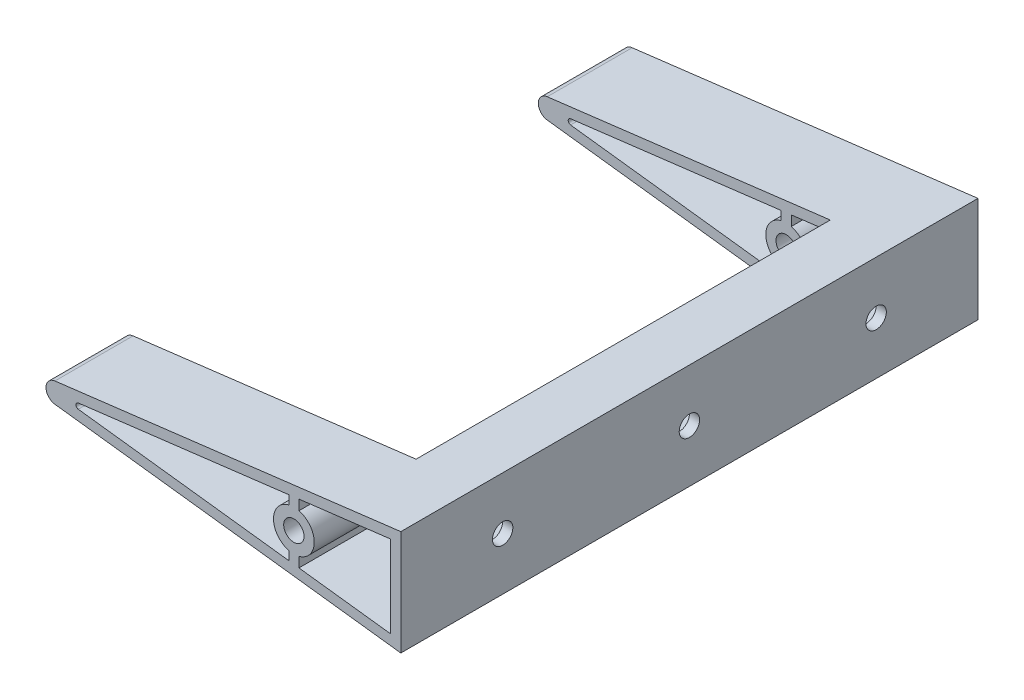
from build123d import *

# Parameters (mm, degrees)
ESQUISSE1_R             = 3
BOSS_EXTRU_1_DEPTH      = 120
ESQUISSE1_2_R           = 3
BOSS_EXTRU_2_DEPTH      = 170
ESQUISSE3_W             = 120
ESQUISSE3_H             = 122
ENL_V_MAT_EXTRU_1_DEPTH = 30
CONG_2_R                = 3
ESQUISSE4_R             = 3
ENL_V_MAT_EXTRU_2_DEPTH = 10


with BuildPart() as part:
    # Esquisse1 → Boss.-Extru.1 (new body)
    with BuildSketch(Plane.XY):
        Polygon((-94.616527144, 0), (31.5, 15.485162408), (31.5, -15.485162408), align=None)
        with Locations(Location((0, 0, 0), (0, 0, 180))):
            Circle(ESQUISSE1_R, mode=Mode.SUBTRACT)
        with BuildLine():
            Line((28.5, 12.094279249), (28.5, -12.094279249))
            Line((28.5, -12.094279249), (1.5, -8.779096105))
            Line((1.5, -8.779096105), (1.5, -5.809475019))
            ThreePointArc((1.5, -5.809475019), (6, 0), (1.5, 5.809475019))
            Line((1.5, 5.809475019), (1.5, 8.779096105))
            Line((1.5, 8.779096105), (28.5, 12.094279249))
        make_face(mode=Mode.SUBTRACT)
        with BuildLine():
            Line((-63.496985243, 0.798469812), (-1.5, 8.410742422))
            Line((-1.5, 8.410742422), (-1.5, 5.809475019))
            ThreePointArc((-1.5, 5.809475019), (-6, 0), (-1.5, -5.809475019))
            Line((-1.5, -5.809475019), (-1.5, -8.410742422))
            Line((-1.5, -8.410742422), (-63.496985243, -0.798469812))
            ThreePointArc((-63.496985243, -0.798469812), (-64.187284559, 0), (-63.496985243, 0.798469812))
        make_face(mode=Mode.SUBTRACT)
    extrude(amount=BOSS_EXTRU_1_DEPTH)

    # Esquisse1_2 → Boss.-Extru.2 (add)
    with BuildSketch(Plane.XY):
        Polygon((-94.616527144, 0), (31.5, 15.485162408), (31.5, -15.485162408), align=None)
        with Locations(Location((0, 0, 0), (0, 0, 180))):
            Circle(ESQUISSE1_2_R, mode=Mode.SUBTRACT)
        with BuildLine():
            Line((28.5, 12.094279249), (28.5, -12.094279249))
            Line((28.5, -12.094279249), (1.5, -8.779096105))
            Line((1.5, -8.779096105), (1.5, -5.809475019))
            ThreePointArc((1.5, -5.809475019), (6, 0), (1.5, 5.809475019))
            Line((1.5, 5.809475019), (1.5, 8.779096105))
            Line((1.5, 8.779096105), (28.5, 12.094279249))
        make_face(mode=Mode.SUBTRACT)
        with BuildLine():
            Line((-63.496985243, 0.798469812), (-1.5, 8.410742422))
            Line((-1.5, 8.410742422), (-1.5, 5.809475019))
            ThreePointArc((-1.5, 5.809475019), (-6, 0), (-1.5, -5.809475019))
            Line((-1.5, -5.809475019), (-1.5, -8.410742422))
            Line((-1.5, -8.410742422), (-63.496985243, -0.798469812))
            ThreePointArc((-63.496985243, -0.798469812), (-64.187284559, 0), (-63.496985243, 0.798469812))
        make_face(mode=Mode.SUBTRACT)
    extrude(amount=BOSS_EXTRU_2_DEPTH)

    # Esquisse3 → Enl_v. mat.-Extru.1 (cut, symmetric)
    with BuildSketch(Plane(origin=(0, 0, 0), x_dir=(1, 0, 0), z_dir=(0, 1, 0))):
        with Locations((-47, -86)):
            Rectangle(ESQUISSE3_W, ESQUISSE3_H)
    extrude(amount=ENL_V_MAT_EXTRU_1_DEPTH, both=True, mode=Mode.SUBTRACT)

    # Cong_2
    cong_2_edges = [part.edges().sort_by_distance(p)[0] for p in [
        (-94.616527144, 0, 12.5),
        (-94.616527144, 0, 158.5),
    ]]
    fillet(cong_2_edges, radius=CONG_2_R)

    # Esquisse4 → Enl_v. mat.-Extru.2 (cut)
    with BuildSketch(Plane(origin=(31.5, 0, 0), x_dir=(0, 0, -1), z_dir=(1, 0, 0))):
        with Locations(Location((-140, 0, 0), (0, 0, 90))):
            Circle(ESQUISSE4_R)
        with Locations(Location((-85, 0, 0), (0, 0, 90))):
            Circle(ESQUISSE4_R)
        with Locations(Location((-30, 0, 0), (0, 0, 90))):
            Circle(ESQUISSE4_R)
    extrude(amount=-ENL_V_MAT_EXTRU_2_DEPTH, mode=Mode.SUBTRACT)


solid = part.part
